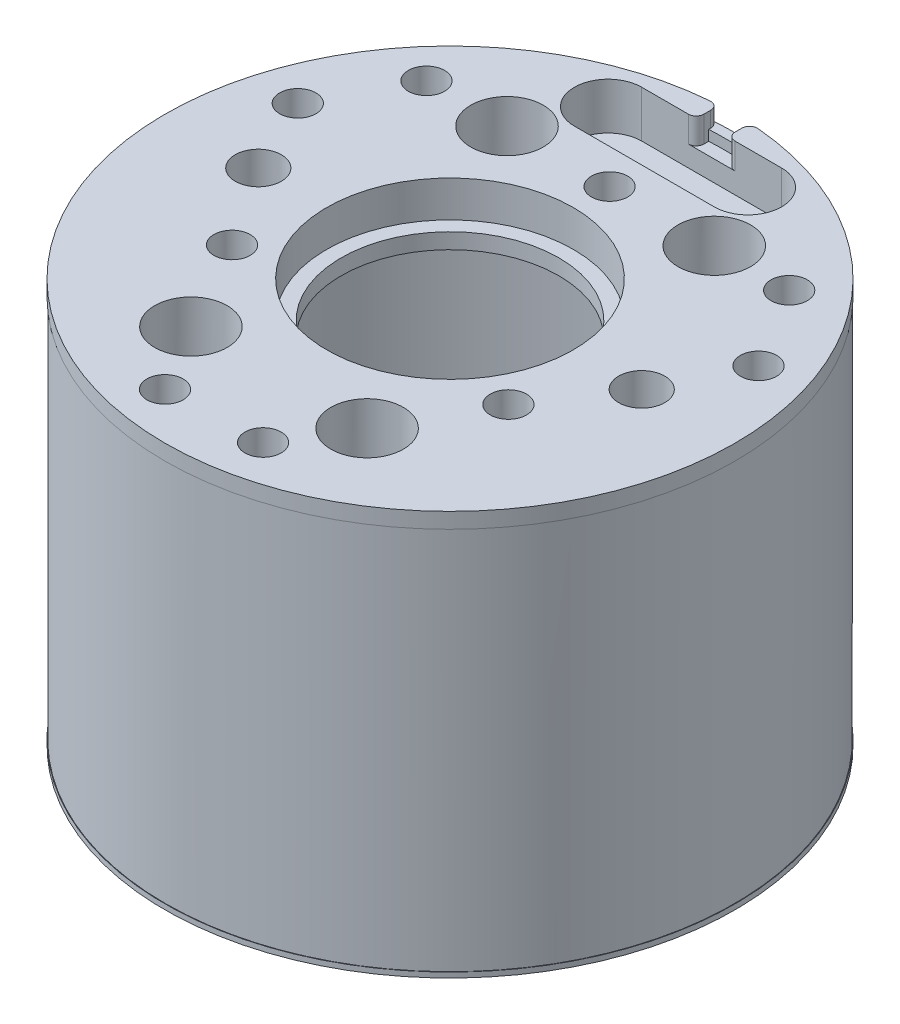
ISO-10303-21;
HEADER;
FILE_DESCRIPTION(('STEP AP214'),'2;1');
FILE_NAME('part.step','',(''),(''),'','','');
FILE_SCHEMA(('AUTOMOTIVE_DESIGN { 1 0 10303 214 1 1 1 1 }'));
ENDSEC;
DATA;
#1=APPLICATION_CONTEXT('core data for automotive mechanical design processes');
#2=APPLICATION_PROTOCOL_DEFINITION('international standard','automotive_design',2000,#1);
#3=PRODUCT_CONTEXT('',#1,'mechanical');
#4=PRODUCT('Part','Part','',(#3));
#5=PRODUCT_RELATED_PRODUCT_CATEGORY('part','',(#4));
#6=PRODUCT_DEFINITION_FORMATION('','',#4);
#7=PRODUCT_DEFINITION_CONTEXT('part definition',#1,'design');
#8=PRODUCT_DEFINITION('design','',#6,#7);
#9=PRODUCT_DEFINITION_SHAPE('','',#8);
#10=(LENGTH_UNIT() NAMED_UNIT(*) SI_UNIT(.MILLI.,.METRE.));
#11=(NAMED_UNIT(*) PLANE_ANGLE_UNIT() SI_UNIT($,.RADIAN.));
#12=(NAMED_UNIT(*) SI_UNIT($,.STERADIAN.) SOLID_ANGLE_UNIT());
#13=UNCERTAINTY_MEASURE_WITH_UNIT(LENGTH_MEASURE(1.E-05),#10,'distance_accuracy_value','');
#14=(GEOMETRIC_REPRESENTATION_CONTEXT(3) GLOBAL_UNCERTAINTY_ASSIGNED_CONTEXT((#13)) GLOBAL_UNIT_ASSIGNED_CONTEXT((#10,
#11,#12)) REPRESENTATION_CONTEXT('',''));
#15=CARTESIAN_POINT('',(0.,0.,0.));
#16=DIRECTION('',(0.,0.,1.));
#17=DIRECTION('',(1.,0.,0.));
#18=AXIS2_PLACEMENT_3D('',#15,#16,#17);
#19=CARTESIAN_POINT('',(5.334,17.272,0.));
#20=DIRECTION('',(0.,-1.,0.));
#21=DIRECTION('',(0.,0.,-1.));
#22=AXIS2_PLACEMENT_3D('',#19,#20,#21);
#23=PLANE('',#22);
#24=CARTESIAN_POINT('',(5.08,17.272,-7.874));
#25=DIRECTION('',(0.,-1.,0.));
#26=DIRECTION('',(0.,0.,-1.));
#27=AXIS2_PLACEMENT_3D('',#24,#25,#26);
#28=CIRCLE('',#27,1.778);
#29=CARTESIAN_POINT('',(5.08,17.272,-9.652));
#30=VERTEX_POINT('',#29);
#31=EDGE_CURVE('E255',#30,#30,#28,.T.);
#32=ORIENTED_EDGE('',*,*,#31,.F.);
#33=EDGE_LOOP('',(#32));
#34=FACE_BOUND('',#33,.T.);
#35=CARTESIAN_POINT('',(-5.08,17.272,-7.874));
#36=DIRECTION('',(0.,-1.,0.));
#37=DIRECTION('',(0.,0.,-1.));
#38=AXIS2_PLACEMENT_3D('',#35,#36,#37);
#39=CIRCLE('',#38,1.778);
#40=CARTESIAN_POINT('',(-5.08,17.272,-9.652));
#41=VERTEX_POINT('',#40);
#42=EDGE_CURVE('E252',#41,#41,#39,.T.);
#43=ORIENTED_EDGE('',*,*,#42,.F.);
#44=EDGE_LOOP('',(#43));
#45=FACE_BOUND('',#44,.T.);
#46=CARTESIAN_POINT('',(-4.318,17.272,8.382));
#47=DIRECTION('',(0.,-1.,0.));
#48=DIRECTION('',(0.,0.,-1.));
#49=AXIS2_PLACEMENT_3D('',#46,#47,#48);
#50=CIRCLE('',#49,1.778);
#51=CARTESIAN_POINT('',(-4.318,17.272,6.604));
#52=VERTEX_POINT('',#51);
#53=EDGE_CURVE('E249',#52,#52,#50,.T.);
#54=ORIENTED_EDGE('',*,*,#53,.F.);
#55=EDGE_LOOP('',(#54));
#56=FACE_BOUND('',#55,.T.);
#57=CARTESIAN_POINT('',(4.318,17.272,8.382));
#58=DIRECTION('',(0.,-1.,0.));
#59=DIRECTION('',(0.,0.,-1.));
#60=AXIS2_PLACEMENT_3D('',#57,#58,#59);
#61=CIRCLE('',#60,1.778);
#62=CARTESIAN_POINT('',(4.318,17.272,6.604));
#63=VERTEX_POINT('',#62);
#64=EDGE_CURVE('E246',#63,#63,#61,.T.);
#65=ORIENTED_EDGE('',*,*,#64,.F.);
#66=EDGE_LOOP('',(#65));
#67=FACE_BOUND('',#66,.T.);
#68=CARTESIAN_POINT('',(-9.398,17.272,0.));
#69=DIRECTION('',(0.,-1.,0.));
#70=DIRECTION('',(0.,0.,-1.));
#71=AXIS2_PLACEMENT_3D('',#68,#69,#70);
#72=CIRCLE('',#71,1.13029999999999);
#73=CARTESIAN_POINT('',(-9.398,17.272,-1.13029999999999));
#74=VERTEX_POINT('',#73);
#75=EDGE_CURVE('E261',#74,#74,#72,.T.);
#76=ORIENTED_EDGE('',*,*,#75,.F.);
#77=EDGE_LOOP('',(#76));
#78=FACE_BOUND('',#77,.T.);
#79=CARTESIAN_POINT('',(9.398,17.272,0.));
#80=DIRECTION('',(0.,-1.,0.));
#81=DIRECTION('',(0.,0.,-1.));
#82=AXIS2_PLACEMENT_3D('',#79,#80,#81);
#83=CIRCLE('',#82,1.13029999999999);
#84=CARTESIAN_POINT('',(9.398,17.272,-1.13029999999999));
#85=VERTEX_POINT('',#84);
#86=EDGE_CURVE('E267',#85,#85,#83,.T.);
#87=ORIENTED_EDGE('',*,*,#86,.F.);
#88=EDGE_LOOP('',(#87));
#89=FACE_BOUND('',#88,.T.);
#90=CARTESIAN_POINT('',(2.37164081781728,17.272,11.5356657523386));
#91=DIRECTION('',(0.,-1.,0.));
#92=DIRECTION('',(0.,0.,-1.));
#93=AXIS2_PLACEMENT_3D('',#90,#91,#92);
#94=CIRCLE('',#93,0.888999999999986);
#95=CARTESIAN_POINT('',(2.37164081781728,17.272,10.6466657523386));
#96=VERTEX_POINT('',#95);
#97=EDGE_CURVE('E273',#96,#96,#94,.T.);
#98=ORIENTED_EDGE('',*,*,#97,.F.);
#99=EDGE_LOOP('',(#98));
#100=FACE_BOUND('',#99,.T.);
#101=CARTESIAN_POINT('',(6.77382040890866,17.272,3.91086703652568));
#102=DIRECTION('',(0.,-1.,0.));
#103=DIRECTION('',(0.,0.,-1.));
#104=AXIS2_PLACEMENT_3D('',#101,#102,#103);
#105=CIRCLE('',#104,0.888999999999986);
#106=CARTESIAN_POINT('',(6.77382040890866,17.272,3.02186703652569));
#107=VERTEX_POINT('',#106);
#108=EDGE_CURVE('E279',#107,#107,#105,.T.);
#109=ORIENTED_EDGE('',*,*,#108,.F.);
#110=EDGE_LOOP('',(#109));
#111=FACE_BOUND('',#110,.T.);
#112=CARTESIAN_POINT('',(11.2616408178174,17.272,-3.86226592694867));
#113=DIRECTION('',(0.,-1.,0.));
#114=DIRECTION('',(0.,0.,-1.));
#115=AXIS2_PLACEMENT_3D('',#112,#113,#114);
#116=CIRCLE('',#115,0.888999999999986);
#117=CARTESIAN_POINT('',(11.2616408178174,17.272,-4.75126592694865));
#118=VERTEX_POINT('',#117);
#119=EDGE_CURVE('E285',#118,#118,#116,.T.);
#120=ORIENTED_EDGE('',*,*,#119,.F.);
#121=EDGE_LOOP('',(#120));
#122=FACE_BOUND('',#121,.T.);
#123=CARTESIAN_POINT('',(8.80435918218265,17.272,-7.82173407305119));
#124=DIRECTION('',(0.,-1.,0.));
#125=DIRECTION('',(0.,0.,-1.));
#126=AXIS2_PLACEMENT_3D('',#123,#124,#125);
#127=CIRCLE('',#126,0.888999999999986);
#128=CARTESIAN_POINT('',(8.80435918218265,17.272,-8.71073407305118));
#129=VERTEX_POINT('',#128);
#130=EDGE_CURVE('E291',#129,#129,#127,.T.);
#131=ORIENTED_EDGE('',*,*,#130,.F.);
#132=EDGE_LOOP('',(#131));
#133=FACE_BOUND('',#132,.T.);
#134=CARTESIAN_POINT('',(0.,17.272,-7.82173407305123));
#135=DIRECTION('',(0.,-1.,0.));
#136=DIRECTION('',(0.,0.,-1.));
#137=AXIS2_PLACEMENT_3D('',#134,#135,#136);
#138=CIRCLE('',#137,0.888999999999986);
#139=CARTESIAN_POINT('',(0.,17.272,-8.71073407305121));
#140=VERTEX_POINT('',#139);
#141=EDGE_CURVE('E297',#140,#140,#138,.T.);
#142=ORIENTED_EDGE('',*,*,#141,.F.);
#143=EDGE_LOOP('',(#142));
#144=FACE_BOUND('',#143,.T.);
#145=CARTESIAN_POINT('',(-8.97564081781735,17.272,-7.82173407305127));
#146=DIRECTION('',(0.,-1.,0.));
#147=DIRECTION('',(0.,0.,-1.));
#148=AXIS2_PLACEMENT_3D('',#145,#146,#147);
#149=CIRCLE('',#148,0.888999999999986);
#150=CARTESIAN_POINT('',(-8.97564081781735,17.272,-8.71073407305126));
#151=VERTEX_POINT('',#150);
#152=EDGE_CURVE('E303',#151,#151,#149,.T.);
#153=ORIENTED_EDGE('',*,*,#152,.F.);
#154=EDGE_LOOP('',(#153));
#155=FACE_BOUND('',#154,.T.);
#156=CARTESIAN_POINT('',(-11.176,17.272,-3.71393167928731));
#157=DIRECTION('',(0.,-1.,0.));
#158=DIRECTION('',(0.,0.,-1.));
#159=AXIS2_PLACEMENT_3D('',#156,#157,#158);
#160=CIRCLE('',#159,0.888999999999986);
#161=CARTESIAN_POINT('',(-11.176,17.272,-4.6029316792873));
#162=VERTEX_POINT('',#161);
#163=EDGE_CURVE('E307',#162,#162,#160,.T.);
#164=ORIENTED_EDGE('',*,*,#163,.F.);
#165=EDGE_LOOP('',(#164));
#166=FACE_BOUND('',#165,.T.);
#167=CARTESIAN_POINT('',(-6.77382040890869,17.272,3.91086703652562));
#168=DIRECTION('',(0.,-1.,0.));
#169=DIRECTION('',(0.,0.,-1.));
#170=AXIS2_PLACEMENT_3D('',#167,#168,#169);
#171=CIRCLE('',#170,0.888999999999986);
#172=CARTESIAN_POINT('',(-6.77382040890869,17.272,3.02186703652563));
#173=VERTEX_POINT('',#172);
#174=EDGE_CURVE('E311',#173,#173,#171,.T.);
#175=ORIENTED_EDGE('',*,*,#174,.F.);
#176=EDGE_LOOP('',(#175));
#177=FACE_BOUND('',#176,.T.);
#178=CARTESIAN_POINT('',(-2.286,17.272,11.684));
#179=DIRECTION('',(0.,-1.,0.));
#180=DIRECTION('',(0.,0.,-1.));
#181=AXIS2_PLACEMENT_3D('',#178,#179,#180);
#182=CIRCLE('',#181,0.888999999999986);
#183=CARTESIAN_POINT('',(-2.286,17.272,10.795));
#184=VERTEX_POINT('',#183);
#185=EDGE_CURVE('E317',#184,#184,#182,.T.);
#186=ORIENTED_EDGE('',*,*,#185,.F.);
#187=EDGE_LOOP('',(#186));
#188=FACE_BOUND('',#187,.T.);
#189=CARTESIAN_POINT('',(0.,17.272,0.));
#190=DIRECTION('',(0.,-1.,0.));
#191=DIRECTION('',(0.,0.,-1.));
#192=AXIS2_PLACEMENT_3D('',#189,#190,#191);
#193=CIRCLE('',#192,13.208);
#194=CARTESIAN_POINT('',(0.,17.272,-13.208));
#195=VERTEX_POINT('',#194);
#196=EDGE_CURVE('E320',#195,#195,#193,.T.);
#197=ORIENTED_EDGE('',*,*,#196,.T.);
#198=EDGE_LOOP('',(#197));
#199=FACE_BOUND('',#198,.T.);
#200=CARTESIAN_POINT('',(0.,17.272,0.));
#201=DIRECTION('',(0.,-1.,0.));
#202=DIRECTION('',(0.,0.,-1.));
#203=AXIS2_PLACEMENT_3D('',#200,#201,#202);
#204=CIRCLE('',#203,5.334);
#205=CARTESIAN_POINT('',(0.,17.272,-5.334));
#206=VERTEX_POINT('',#205);
#207=EDGE_CURVE('E345',#206,#206,#204,.T.);
#208=ORIENTED_EDGE('',*,*,#207,.F.);
#209=EDGE_LOOP('',(#208));
#210=FACE_BOUND('',#209,.T.);
#211=ADVANCED_FACE('F35',(#34,#45,#56,#67,#78,#89,#100,#111,#122,#133,#144,#155,#166,#177,#188,
#199,#210),#23,.T.);
#212=CARTESIAN_POINT('',(0.,0.,0.));
#213=DIRECTION('',(0.,-1.,0.));
#214=DIRECTION('',(0.,0.,-1.));
#215=AXIS2_PLACEMENT_3D('',#212,#213,#214);
#216=CYLINDRICAL_SURFACE('',#215,5.334);
#217=ORIENTED_EDGE('',*,*,#207,.T.);
#218=EDGE_LOOP('',(#217));
#219=FACE_BOUND('',#218,.T.);
#220=CARTESIAN_POINT('',(0.,18.034,0.));
#221=DIRECTION('',(0.,-1.,0.));
#222=DIRECTION('',(0.,0.,-1.));
#223=AXIS2_PLACEMENT_3D('',#220,#221,#222);
#224=CIRCLE('',#223,5.334);
#225=CARTESIAN_POINT('',(0.,18.034,-5.334));
#226=VERTEX_POINT('',#225);
#227=EDGE_CURVE('E342',#226,#226,#224,.T.);
#228=ORIENTED_EDGE('',*,*,#227,.F.);
#229=EDGE_LOOP('',(#228));
#230=FACE_BOUND('',#229,.T.);
#231=ADVANCED_FACE('F442',(#219,#230),#216,.F.);
#232=CARTESIAN_POINT('',(6.0452,18.034,0.));
#233=DIRECTION('',(0.,1.,0.));
#234=DIRECTION('',(0.,0.,1.));
#235=AXIS2_PLACEMENT_3D('',#232,#233,#234);
#236=PLANE('',#235);
#237=ORIENTED_EDGE('',*,*,#227,.T.);
#238=EDGE_LOOP('',(#237));
#239=FACE_BOUND('',#238,.T.);
#240=CARTESIAN_POINT('',(0.,18.034,0.));
#241=DIRECTION('',(0.,-1.,0.));
#242=DIRECTION('',(0.,0.,-1.));
#243=AXIS2_PLACEMENT_3D('',#240,#241,#242);
#244=CIRCLE('',#243,6.0452);
#245=CARTESIAN_POINT('',(0.,18.034,-6.0452));
#246=VERTEX_POINT('',#245);
#247=EDGE_CURVE('E339',#246,#246,#244,.T.);
#248=ORIENTED_EDGE('',*,*,#247,.F.);
#249=EDGE_LOOP('',(#248));
#250=FACE_BOUND('',#249,.T.);
#251=ADVANCED_FACE('F448',(#239,#250),#236,.T.);
#252=CARTESIAN_POINT('',(0.,0.,0.));
#253=DIRECTION('',(0.,-1.,0.));
#254=DIRECTION('',(0.,0.,-1.));
#255=AXIS2_PLACEMENT_3D('',#252,#253,#254);
#256=CYLINDRICAL_SURFACE('',#255,6.0452);
#257=ORIENTED_EDGE('',*,*,#247,.T.);
#258=EDGE_LOOP('',(#257));
#259=FACE_BOUND('',#258,.T.);
#260=CARTESIAN_POINT('',(0.,19.812,0.));
#261=DIRECTION('',(0.,-1.,0.));
#262=DIRECTION('',(0.,0.,-1.));
#263=AXIS2_PLACEMENT_3D('',#260,#261,#262);
#264=CIRCLE('',#263,6.0452);
#265=CARTESIAN_POINT('',(0.,19.812,-6.0452));
#266=VERTEX_POINT('',#265);
#267=EDGE_CURVE('E336',#266,#266,#264,.T.);
#268=ORIENTED_EDGE('',*,*,#267,.F.);
#269=EDGE_LOOP('',(#268));
#270=FACE_BOUND('',#269,.T.);
#271=ADVANCED_FACE('F439',(#259,#270),#256,.F.);
#272=CARTESIAN_POINT('',(13.97,19.812,0.));
#273=DIRECTION('',(0.,1.,0.));
#274=DIRECTION('',(0.,0.,1.));
#275=AXIS2_PLACEMENT_3D('',#272,#273,#274);
#276=PLANE('',#275);
#277=DIRECTION('',(0.,0.,-1.));
#278=VECTOR('',#277,1.);
#279=CARTESIAN_POINT('',(0.762,19.812,-12.827));
#280=LINE('',#279,#278);
#281=CARTESIAN_POINT('',(0.762,19.812,-13.208));
#282=VERTEX_POINT('',#281);
#283=CARTESIAN_POINT('',(0.762,19.812,-13.540844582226));
#284=VERTEX_POINT('',#283);
#285=EDGE_CURVE('E181',#282,#284,#280,.T.);
#286=ORIENTED_EDGE('',*,*,#285,.F.);
#287=CARTESIAN_POINT('',(1.143,19.812,-13.208));
#288=DIRECTION('',(0.,1.,0.));
#289=DIRECTION('',(0.,0.,1.));
#290=AXIS2_PLACEMENT_3D('',#287,#288,#289);
#291=CIRCLE('',#290,0.381);
#292=CARTESIAN_POINT('',(1.143,19.812,-12.827));
#293=VERTEX_POINT('',#292);
#294=EDGE_CURVE('E363',#282,#293,#291,.T.);
#295=ORIENTED_EDGE('',*,*,#294,.T.);
#296=DIRECTION('',(-1.,0.,0.));
#297=VECTOR('',#296,1.);
#298=CARTESIAN_POINT('',(-3.429,19.812,-12.827));
#299=LINE('',#298,#297);
#300=CARTESIAN_POINT('',(3.429,19.812,-12.827));
#301=VERTEX_POINT('',#300);
#302=EDGE_CURVE('E205',#301,#293,#299,.T.);
#303=ORIENTED_EDGE('',*,*,#302,.F.);
#304=CARTESIAN_POINT('',(3.429,19.812,-11.176));
#305=DIRECTION('',(0.,1.,0.));
#306=DIRECTION('',(0.,0.,1.));
#307=AXIS2_PLACEMENT_3D('',#304,#305,#306);
#308=CIRCLE('',#307,1.651);
#309=CARTESIAN_POINT('',(3.429,19.812,-9.525));
#310=VERTEX_POINT('',#309);
#311=EDGE_CURVE('E219',#310,#301,#308,.T.);
#312=ORIENTED_EDGE('',*,*,#311,.F.);
#313=DIRECTION('',(1.,0.,0.));
#314=VECTOR('',#313,1.);
#315=CARTESIAN_POINT('',(-3.429,19.812,-9.525));
#316=LINE('',#315,#314);
#317=CARTESIAN_POINT('',(-3.429,19.812,-9.525));
#318=VERTEX_POINT('',#317);
#319=EDGE_CURVE('E216',#318,#310,#316,.T.);
#320=ORIENTED_EDGE('',*,*,#319,.F.);
#321=CARTESIAN_POINT('',(-3.429,19.812,-11.176));
#322=DIRECTION('',(0.,1.,0.));
#323=DIRECTION('',(0.,0.,1.));
#324=AXIS2_PLACEMENT_3D('',#321,#322,#323);
#325=CIRCLE('',#324,1.651);
#326=CARTESIAN_POINT('',(-3.429,19.812,-12.827));
#327=VERTEX_POINT('',#326);
#328=EDGE_CURVE('E200',#327,#318,#325,.T.);
#329=ORIENTED_EDGE('',*,*,#328,.F.);
#330=CARTESIAN_POINT('',(-1.143,19.812,-12.827));
#331=VERTEX_POINT('',#330);
#332=EDGE_CURVE('E222',#331,#327,#299,.T.);
#333=ORIENTED_EDGE('',*,*,#332,.F.);
#334=CARTESIAN_POINT('',(-1.143,19.812,-13.208));
#335=DIRECTION('',(0.,1.,0.));
#336=DIRECTION('',(0.,0.,1.));
#337=AXIS2_PLACEMENT_3D('',#334,#335,#336);
#338=CIRCLE('',#337,0.381);
#339=CARTESIAN_POINT('',(-0.762,19.812,-13.208));
#340=VERTEX_POINT('',#339);
#341=EDGE_CURVE('E361',#331,#340,#338,.T.);
#342=ORIENTED_EDGE('',*,*,#341,.T.);
#343=DIRECTION('',(0.,0.,1.));
#344=VECTOR('',#343,1.);
#345=CARTESIAN_POINT('',(-0.762,19.812,-12.827));
#346=LINE('',#345,#344);
#347=CARTESIAN_POINT('',(-0.762,19.812,-13.540844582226));
#348=VERTEX_POINT('',#347);
#349=EDGE_CURVE('E176',#348,#340,#346,.T.);
#350=ORIENTED_EDGE('',*,*,#349,.F.);
#351=CARTESIAN_POINT('',(-1.143,19.812,-13.540844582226));
#352=DIRECTION('',(0.,1.,0.));
#353=DIRECTION('',(0.,0.,1.));
#354=AXIS2_PLACEMENT_3D('',#351,#352,#353);
#355=CIRCLE('',#354,0.381);
#356=CARTESIAN_POINT('',(-1.17504672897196,19.812,-13.9204944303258));
#357=VERTEX_POINT('',#356);
#358=EDGE_CURVE('E359',#348,#357,#355,.T.);
#359=ORIENTED_EDGE('',*,*,#358,.T.);
#360=CARTESIAN_POINT('',(0.,19.812,0.));
#361=DIRECTION('',(0.,-1.,0.));
#362=DIRECTION('',(0.,0.,-1.));
#363=AXIS2_PLACEMENT_3D('',#360,#361,#362);
#364=CIRCLE('',#363,13.97);
#365=CARTESIAN_POINT('',(1.17504672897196,19.812,-13.9204944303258));
#366=VERTEX_POINT('',#365);
#367=EDGE_CURVE('E334',#366,#357,#364,.T.);
#368=ORIENTED_EDGE('',*,*,#367,.F.);
#369=CARTESIAN_POINT('',(1.143,19.812,-13.540844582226));
#370=DIRECTION('',(0.,1.,0.));
#371=DIRECTION('',(0.,0.,1.));
#372=AXIS2_PLACEMENT_3D('',#369,#370,#371);
#373=CIRCLE('',#372,0.381);
#374=EDGE_CURVE('E357',#366,#284,#373,.T.);
#375=ORIENTED_EDGE('',*,*,#374,.T.);
#376=EDGE_LOOP('',(#286,#295,#303,#312,#320,#329,#333,#342,#350,#359,#368,#375));
#377=FACE_BOUND('',#376,.T.);
#378=CARTESIAN_POINT('',(5.08,19.812,-7.874));
#379=DIRECTION('',(0.,1.,0.));
#380=DIRECTION('',(0.,0.,1.));
#381=AXIS2_PLACEMENT_3D('',#378,#379,#380);
#382=CIRCLE('',#381,1.778);
#383=CARTESIAN_POINT('',(5.08,19.812,-6.096));
#384=VERTEX_POINT('',#383);
#385=EDGE_CURVE('E228',#384,#384,#382,.T.);
#386=ORIENTED_EDGE('',*,*,#385,.F.);
#387=EDGE_LOOP('',(#386));
#388=FACE_BOUND('',#387,.T.);
#389=CARTESIAN_POINT('',(-5.08,19.812,-7.874));
#390=DIRECTION('',(0.,1.,0.));
#391=DIRECTION('',(0.,0.,1.));
#392=AXIS2_PLACEMENT_3D('',#389,#390,#391);
#393=CIRCLE('',#392,1.778);
#394=CARTESIAN_POINT('',(-5.08,19.812,-6.096));
#395=VERTEX_POINT('',#394);
#396=EDGE_CURVE('E239',#395,#395,#393,.T.);
#397=ORIENTED_EDGE('',*,*,#396,.F.);
#398=EDGE_LOOP('',(#397));
#399=FACE_BOUND('',#398,.T.);
#400=CARTESIAN_POINT('',(-4.318,19.812,8.382));
#401=DIRECTION('',(0.,1.,0.));
#402=DIRECTION('',(0.,0.,1.));
#403=AXIS2_PLACEMENT_3D('',#400,#401,#402);
#404=CIRCLE('',#403,1.778);
#405=CARTESIAN_POINT('',(-4.318,19.812,10.16));
#406=VERTEX_POINT('',#405);
#407=EDGE_CURVE('E235',#406,#406,#404,.T.);
#408=ORIENTED_EDGE('',*,*,#407,.F.);
#409=EDGE_LOOP('',(#408));
#410=FACE_BOUND('',#409,.T.);
#411=CARTESIAN_POINT('',(4.318,19.812,8.382));
#412=DIRECTION('',(0.,1.,0.));
#413=DIRECTION('',(0.,0.,1.));
#414=AXIS2_PLACEMENT_3D('',#411,#412,#413);
#415=CIRCLE('',#414,1.778);
#416=CARTESIAN_POINT('',(4.318,19.812,10.16));
#417=VERTEX_POINT('',#416);
#418=EDGE_CURVE('E238',#417,#417,#415,.T.);
#419=ORIENTED_EDGE('',*,*,#418,.F.);
#420=EDGE_LOOP('',(#419));
#421=FACE_BOUND('',#420,.T.);
#422=CARTESIAN_POINT('',(-9.398,19.812,0.));
#423=DIRECTION('',(0.,1.,0.));
#424=DIRECTION('',(0.,0.,1.));
#425=AXIS2_PLACEMENT_3D('',#422,#423,#424);
#426=CIRCLE('',#425,1.13029999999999);
#427=CARTESIAN_POINT('',(-9.398,19.812,1.13029999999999));
#428=VERTEX_POINT('',#427);
#429=EDGE_CURVE('E258',#428,#428,#426,.T.);
#430=ORIENTED_EDGE('',*,*,#429,.F.);
#431=EDGE_LOOP('',(#430));
#432=FACE_BOUND('',#431,.T.);
#433=CARTESIAN_POINT('',(9.398,19.812,0.));
#434=DIRECTION('',(0.,1.,0.));
#435=DIRECTION('',(0.,0.,1.));
#436=AXIS2_PLACEMENT_3D('',#433,#434,#435);
#437=CIRCLE('',#436,1.13029999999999);
#438=CARTESIAN_POINT('',(9.398,19.812,1.13029999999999));
#439=VERTEX_POINT('',#438);
#440=EDGE_CURVE('E264',#439,#439,#437,.T.);
#441=ORIENTED_EDGE('',*,*,#440,.F.);
#442=EDGE_LOOP('',(#441));
#443=FACE_BOUND('',#442,.T.);
#444=CARTESIAN_POINT('',(2.37164081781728,19.812,11.5356657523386));
#445=DIRECTION('',(0.,1.,0.));
#446=DIRECTION('',(0.,0.,1.));
#447=AXIS2_PLACEMENT_3D('',#444,#445,#446);
#448=CIRCLE('',#447,0.888999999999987);
#449=CARTESIAN_POINT('',(2.37164081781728,19.812,12.4246657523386));
#450=VERTEX_POINT('',#449);
#451=EDGE_CURVE('E270',#450,#450,#448,.T.);
#452=ORIENTED_EDGE('',*,*,#451,.F.);
#453=EDGE_LOOP('',(#452));
#454=FACE_BOUND('',#453,.T.);
#455=CARTESIAN_POINT('',(6.77382040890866,19.812,3.91086703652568));
#456=DIRECTION('',(0.,1.,0.));
#457=DIRECTION('',(0.,0.,1.));
#458=AXIS2_PLACEMENT_3D('',#455,#456,#457);
#459=CIRCLE('',#458,0.888999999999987);
#460=CARTESIAN_POINT('',(6.77382040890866,19.812,4.79986703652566));
#461=VERTEX_POINT('',#460);
#462=EDGE_CURVE('E276',#461,#461,#459,.T.);
#463=ORIENTED_EDGE('',*,*,#462,.F.);
#464=EDGE_LOOP('',(#463));
#465=FACE_BOUND('',#464,.T.);
#466=CARTESIAN_POINT('',(11.2616408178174,19.812,-3.86226592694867));
#467=DIRECTION('',(0.,1.,0.));
#468=DIRECTION('',(0.,0.,1.));
#469=AXIS2_PLACEMENT_3D('',#466,#467,#468);
#470=CIRCLE('',#469,0.888999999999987);
#471=CARTESIAN_POINT('',(11.2616408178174,19.812,-2.97326592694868));
#472=VERTEX_POINT('',#471);
#473=EDGE_CURVE('E282',#472,#472,#470,.T.);
#474=ORIENTED_EDGE('',*,*,#473,.F.);
#475=EDGE_LOOP('',(#474));
#476=FACE_BOUND('',#475,.T.);
#477=CARTESIAN_POINT('',(8.80435918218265,19.812,-7.82173407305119));
#478=DIRECTION('',(0.,1.,0.));
#479=DIRECTION('',(0.,0.,1.));
#480=AXIS2_PLACEMENT_3D('',#477,#478,#479);
#481=CIRCLE('',#480,0.888999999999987);
#482=CARTESIAN_POINT('',(8.80435918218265,19.812,-6.9327340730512));
#483=VERTEX_POINT('',#482);
#484=EDGE_CURVE('E288',#483,#483,#481,.T.);
#485=ORIENTED_EDGE('',*,*,#484,.F.);
#486=EDGE_LOOP('',(#485));
#487=FACE_BOUND('',#486,.T.);
#488=CARTESIAN_POINT('',(0.,19.812,-7.82173407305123));
#489=DIRECTION('',(0.,1.,0.));
#490=DIRECTION('',(0.,0.,1.));
#491=AXIS2_PLACEMENT_3D('',#488,#489,#490);
#492=CIRCLE('',#491,0.888999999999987);
#493=CARTESIAN_POINT('',(0.,19.812,-6.93273407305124));
#494=VERTEX_POINT('',#493);
#495=EDGE_CURVE('E294',#494,#494,#492,.T.);
#496=ORIENTED_EDGE('',*,*,#495,.F.);
#497=EDGE_LOOP('',(#496));
#498=FACE_BOUND('',#497,.T.);
#499=CARTESIAN_POINT('',(-8.97564081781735,19.812,-7.82173407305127));
#500=DIRECTION('',(0.,1.,0.));
#501=DIRECTION('',(0.,0.,1.));
#502=AXIS2_PLACEMENT_3D('',#499,#500,#501);
#503=CIRCLE('',#502,0.888999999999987);
#504=CARTESIAN_POINT('',(-8.97564081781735,19.812,-6.93273407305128));
#505=VERTEX_POINT('',#504);
#506=EDGE_CURVE('E300',#505,#505,#503,.T.);
#507=ORIENTED_EDGE('',*,*,#506,.F.);
#508=EDGE_LOOP('',(#507));
#509=FACE_BOUND('',#508,.T.);
#510=CARTESIAN_POINT('',(-11.176,19.812,-3.71393167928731));
#511=DIRECTION('',(0.,1.,0.));
#512=DIRECTION('',(0.,0.,1.));
#513=AXIS2_PLACEMENT_3D('',#510,#511,#512);
#514=CIRCLE('',#513,0.888999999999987);
#515=CARTESIAN_POINT('',(-11.176,19.812,-2.82493167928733));
#516=VERTEX_POINT('',#515);
#517=EDGE_CURVE('E304',#516,#516,#514,.T.);
#518=ORIENTED_EDGE('',*,*,#517,.F.);
#519=EDGE_LOOP('',(#518));
#520=FACE_BOUND('',#519,.T.);
#521=CARTESIAN_POINT('',(-6.77382040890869,19.812,3.91086703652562));
#522=DIRECTION('',(0.,1.,0.));
#523=DIRECTION('',(0.,0.,1.));
#524=AXIS2_PLACEMENT_3D('',#521,#522,#523);
#525=CIRCLE('',#524,0.888999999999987);
#526=CARTESIAN_POINT('',(-6.77382040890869,19.812,4.7998670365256));
#527=VERTEX_POINT('',#526);
#528=EDGE_CURVE('E308',#527,#527,#525,.T.);
#529=ORIENTED_EDGE('',*,*,#528,.F.);
#530=EDGE_LOOP('',(#529));
#531=FACE_BOUND('',#530,.T.);
#532=CARTESIAN_POINT('',(-2.286,19.812,11.684));
#533=DIRECTION('',(0.,1.,0.));
#534=DIRECTION('',(0.,0.,1.));
#535=AXIS2_PLACEMENT_3D('',#532,#533,#534);
#536=CIRCLE('',#535,0.888999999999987);
#537=CARTESIAN_POINT('',(-2.286,19.812,12.573));
#538=VERTEX_POINT('',#537);
#539=EDGE_CURVE('E314',#538,#538,#536,.T.);
#540=ORIENTED_EDGE('',*,*,#539,.F.);
#541=EDGE_LOOP('',(#540));
#542=FACE_BOUND('',#541,.T.);
#543=ORIENTED_EDGE('',*,*,#267,.T.);
#544=EDGE_LOOP('',(#543));
#545=FACE_BOUND('',#544,.T.);
#546=ADVANCED_FACE('F395',(#377,#388,#399,#410,#421,#432,#443,#454,#465,#476,#487,#498,#509,
#520,#531,#542,#545),#276,.T.);
#547=CARTESIAN_POINT('',(0.,0.,0.));
#548=DIRECTION('',(0.,-1.,0.));
#549=DIRECTION('',(0.,0.,-1.));
#550=AXIS2_PLACEMENT_3D('',#547,#548,#549);
#551=CYLINDRICAL_SURFACE('',#550,13.97);
#552=ORIENTED_EDGE('',*,*,#367,.T.);
#553=DIRECTION('',(0.,-1.,0.));
#554=VECTOR('',#553,1.);
#555=CARTESIAN_POINT('',(-1.17504672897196,0.,-13.9204944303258));
#556=LINE('',#555,#554);
#557=CARTESIAN_POINT('',(-1.17504672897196,19.05,-13.9204944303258));
#558=VERTEX_POINT('',#557);
#559=EDGE_CURVE('E58',#357,#558,#556,.T.);
#560=ORIENTED_EDGE('',*,*,#559,.T.);
#561=CARTESIAN_POINT('',(0.,19.05,0.));
#562=DIRECTION('',(0.,-1.,0.));
#563=DIRECTION('',(0.,0.,-1.));
#564=AXIS2_PLACEMENT_3D('',#561,#562,#563);
#565=CIRCLE('',#564,13.97);
#566=CARTESIAN_POINT('',(1.17504672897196,19.05,-13.9204944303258));
#567=VERTEX_POINT('',#566);
#568=EDGE_CURVE('E332',#567,#558,#565,.T.);
#569=ORIENTED_EDGE('',*,*,#568,.F.);
#570=DIRECTION('',(0.,-1.,0.));
#571=VECTOR('',#570,1.);
#572=CARTESIAN_POINT('',(1.17504672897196,0.,-13.9204944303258));
#573=LINE('',#572,#571);
#574=EDGE_CURVE('E152',#567,#366,#573,.F.);
#575=ORIENTED_EDGE('',*,*,#574,.T.);
#576=EDGE_LOOP('',(#552,#560,#569,#575));
#577=FACE_BOUND('',#576,.T.);
#578=ADVANCED_FACE('F430',(#577),#551,.T.);
#579=CARTESIAN_POINT('',(13.462,19.05,0.));
#580=DIRECTION('',(0.,-1.,0.));
#581=DIRECTION('',(0.,0.,-1.));
#582=AXIS2_PLACEMENT_3D('',#579,#580,#581);
#583=PLANE('',#582);
#584=CARTESIAN_POINT('',(0.,19.05,0.));
#585=DIRECTION('',(0.,-1.,0.));
#586=DIRECTION('',(0.,0.,-1.));
#587=AXIS2_PLACEMENT_3D('',#584,#585,#586);
#588=CIRCLE('',#587,13.9446);
#589=CARTESIAN_POINT('',(1.03478378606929,19.05,-13.9061530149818));
#590=VERTEX_POINT('',#589);
#591=CARTESIAN_POINT('',(-1.03478378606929,19.05,-13.9061530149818));
#592=VERTEX_POINT('',#591);
#593=EDGE_CURVE('E156',#590,#592,#588,.T.);
#594=ORIENTED_EDGE('',*,*,#593,.F.);
#595=CARTESIAN_POINT('',(1.143,19.05,-13.540844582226));
#596=DIRECTION('',(0.,-1.,0.));
#597=DIRECTION('',(0.,0.,-1.));
#598=AXIS2_PLACEMENT_3D('',#595,#596,#597);
#599=CIRCLE('',#598,0.381);
#600=EDGE_CURVE('E145',#590,#567,#599,.T.);
#601=ORIENTED_EDGE('',*,*,#600,.T.);
#602=ORIENTED_EDGE('',*,*,#568,.T.);
#603=CARTESIAN_POINT('',(-1.143,19.05,-13.540844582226));
#604=DIRECTION('',(0.,-1.,0.));
#605=DIRECTION('',(0.,0.,-1.));
#606=AXIS2_PLACEMENT_3D('',#603,#604,#605);
#607=CIRCLE('',#606,0.381);
#608=EDGE_CURVE('E158',#558,#592,#607,.T.);
#609=ORIENTED_EDGE('',*,*,#608,.T.);
#610=EDGE_LOOP('',(#594,#601,#602,#609));
#611=FACE_BOUND('',#610,.T.);
#612=ADVANCED_FACE('F157',(#611),#583,.T.);
#613=CARTESIAN_POINT('',(13.97,0.253999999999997,0.));
#614=DIRECTION('',(0.,1.,0.));
#615=DIRECTION('',(0.,0.,1.));
#616=AXIS2_PLACEMENT_3D('',#613,#614,#615);
#617=PLANE('',#616);
#618=CARTESIAN_POINT('',(0.,0.253999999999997,0.));
#619=DIRECTION('',(0.,1.,0.));
#620=DIRECTION('',(0.,0.,1.));
#621=AXIS2_PLACEMENT_3D('',#618,#619,#620);
#622=CIRCLE('',#621,13.9446);
#623=CARTESIAN_POINT('',(0.,0.253999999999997,13.9446));
#624=VERTEX_POINT('',#623);
#625=EDGE_CURVE('E11',#624,#624,#622,.T.);
#626=ORIENTED_EDGE('',*,*,#625,.F.);
#627=EDGE_LOOP('',(#626));
#628=FACE_BOUND('',#627,.T.);
#629=CARTESIAN_POINT('',(0.,0.253999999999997,0.));
#630=DIRECTION('',(0.,-1.,0.));
#631=DIRECTION('',(0.,0.,-1.));
#632=AXIS2_PLACEMENT_3D('',#629,#630,#631);
#633=CIRCLE('',#632,13.97);
#634=CARTESIAN_POINT('',(0.,0.253999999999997,-13.97));
#635=VERTEX_POINT('',#634);
#636=EDGE_CURVE('E329',#635,#635,#633,.T.);
#637=ORIENTED_EDGE('',*,*,#636,.F.);
#638=EDGE_LOOP('',(#637));
#639=FACE_BOUND('',#638,.T.);
#640=ADVANCED_FACE('F437',(#628,#639),#617,.T.);
#641=CARTESIAN_POINT('',(0.,0.,0.));
#642=DIRECTION('',(0.,-1.,0.));
#643=DIRECTION('',(0.,0.,-1.));
#644=AXIS2_PLACEMENT_3D('',#641,#642,#643);
#645=CYLINDRICAL_SURFACE('',#644,13.97);
#646=ORIENTED_EDGE('',*,*,#636,.T.);
#647=EDGE_LOOP('',(#646));
#648=FACE_BOUND('',#647,.T.);
#649=CARTESIAN_POINT('',(0.,0.,0.));
#650=DIRECTION('',(0.,-1.,0.));
#651=DIRECTION('',(0.,0.,-1.));
#652=AXIS2_PLACEMENT_3D('',#649,#650,#651);
#653=CIRCLE('',#652,13.97);
#654=CARTESIAN_POINT('',(0.,0.,-13.97));
#655=VERTEX_POINT('',#654);
#656=EDGE_CURVE('E326',#655,#655,#653,.T.);
#657=ORIENTED_EDGE('',*,*,#656,.F.);
#658=EDGE_LOOP('',(#657));
#659=FACE_BOUND('',#658,.T.);
#660=ADVANCED_FACE('F555',(#648,#659),#645,.T.);
#661=CARTESIAN_POINT('',(13.208,0.,0.));
#662=DIRECTION('',(0.,-1.,0.));
#663=DIRECTION('',(0.,0.,-1.));
#664=AXIS2_PLACEMENT_3D('',#661,#662,#663);
#665=PLANE('',#664);
#666=ORIENTED_EDGE('',*,*,#656,.T.);
#667=EDGE_LOOP('',(#666));
#668=FACE_BOUND('',#667,.T.);
#669=CARTESIAN_POINT('',(0.,0.,0.));
#670=DIRECTION('',(0.,-1.,0.));
#671=DIRECTION('',(0.,0.,-1.));
#672=AXIS2_PLACEMENT_3D('',#669,#670,#671);
#673=CIRCLE('',#672,13.208);
#674=CARTESIAN_POINT('',(0.,0.,-13.208));
#675=VERTEX_POINT('',#674);
#676=EDGE_CURVE('E323',#675,#675,#673,.T.);
#677=ORIENTED_EDGE('',*,*,#676,.F.);
#678=EDGE_LOOP('',(#677));
#679=FACE_BOUND('',#678,.T.);
#680=ADVANCED_FACE('F551',(#668,#679),#665,.T.);
#681=CARTESIAN_POINT('',(0.,0.,0.));
#682=DIRECTION('',(0.,-1.,0.));
#683=DIRECTION('',(0.,0.,-1.));
#684=AXIS2_PLACEMENT_3D('',#681,#682,#683);
#685=CYLINDRICAL_SURFACE('',#684,13.208);
#686=ORIENTED_EDGE('',*,*,#676,.T.);
#687=EDGE_LOOP('',(#686));
#688=FACE_BOUND('',#687,.T.);
#689=ORIENTED_EDGE('',*,*,#196,.F.);
#690=EDGE_LOOP('',(#689));
#691=FACE_BOUND('',#690,.T.);
#692=ADVANCED_FACE('F547',(#688,#691),#685,.F.);
#693=CARTESIAN_POINT('',(-2.286,19.812,11.684));
#694=DIRECTION('',(0.,1.,0.));
#695=DIRECTION('',(0.,0.,1.));
#696=AXIS2_PLACEMENT_3D('',#693,#694,#695);
#697=CYLINDRICAL_SURFACE('',#696,0.888999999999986);
#698=ORIENTED_EDGE('',*,*,#185,.T.);
#699=EDGE_LOOP('',(#698));
#700=FACE_BOUND('',#699,.T.);
#701=ORIENTED_EDGE('',*,*,#539,.T.);
#702=EDGE_LOOP('',(#701));
#703=FACE_BOUND('',#702,.T.);
#704=ADVANCED_FACE('F543',(#700,#703),#697,.F.);
#705=CARTESIAN_POINT('',(-6.77382040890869,19.812,3.91086703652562));
#706=DIRECTION('',(0.,1.,0.));
#707=DIRECTION('',(0.,0.,1.));
#708=AXIS2_PLACEMENT_3D('',#705,#706,#707);
#709=CYLINDRICAL_SURFACE('',#708,0.888999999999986);
#710=ORIENTED_EDGE('',*,*,#174,.T.);
#711=EDGE_LOOP('',(#710));
#712=FACE_BOUND('',#711,.T.);
#713=ORIENTED_EDGE('',*,*,#528,.T.);
#714=EDGE_LOOP('',(#713));
#715=FACE_BOUND('',#714,.T.);
#716=ADVANCED_FACE('F539',(#712,#715),#709,.F.);
#717=CARTESIAN_POINT('',(-11.176,19.812,-3.71393167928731));
#718=DIRECTION('',(0.,1.,0.));
#719=DIRECTION('',(0.,0.,1.));
#720=AXIS2_PLACEMENT_3D('',#717,#718,#719);
#721=CYLINDRICAL_SURFACE('',#720,0.888999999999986);
#722=ORIENTED_EDGE('',*,*,#163,.T.);
#723=EDGE_LOOP('',(#722));
#724=FACE_BOUND('',#723,.T.);
#725=ORIENTED_EDGE('',*,*,#517,.T.);
#726=EDGE_LOOP('',(#725));
#727=FACE_BOUND('',#726,.T.);
#728=ADVANCED_FACE('F535',(#724,#727),#721,.F.);
#729=CARTESIAN_POINT('',(-8.97564081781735,19.812,-7.82173407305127));
#730=DIRECTION('',(0.,1.,0.));
#731=DIRECTION('',(0.,0.,1.));
#732=AXIS2_PLACEMENT_3D('',#729,#730,#731);
#733=CYLINDRICAL_SURFACE('',#732,0.888999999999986);
#734=ORIENTED_EDGE('',*,*,#152,.T.);
#735=EDGE_LOOP('',(#734));
#736=FACE_BOUND('',#735,.T.);
#737=ORIENTED_EDGE('',*,*,#506,.T.);
#738=EDGE_LOOP('',(#737));
#739=FACE_BOUND('',#738,.T.);
#740=ADVANCED_FACE('F531',(#736,#739),#733,.F.);
#741=CARTESIAN_POINT('',(0.,19.812,-7.82173407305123));
#742=DIRECTION('',(0.,1.,0.));
#743=DIRECTION('',(0.,0.,1.));
#744=AXIS2_PLACEMENT_3D('',#741,#742,#743);
#745=CYLINDRICAL_SURFACE('',#744,0.888999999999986);
#746=ORIENTED_EDGE('',*,*,#141,.T.);
#747=EDGE_LOOP('',(#746));
#748=FACE_BOUND('',#747,.T.);
#749=ORIENTED_EDGE('',*,*,#495,.T.);
#750=EDGE_LOOP('',(#749));
#751=FACE_BOUND('',#750,.T.);
#752=ADVANCED_FACE('F527',(#748,#751),#745,.F.);
#753=CARTESIAN_POINT('',(8.80435918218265,19.812,-7.82173407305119));
#754=DIRECTION('',(0.,1.,0.));
#755=DIRECTION('',(0.,0.,1.));
#756=AXIS2_PLACEMENT_3D('',#753,#754,#755);
#757=CYLINDRICAL_SURFACE('',#756,0.888999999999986);
#758=ORIENTED_EDGE('',*,*,#130,.T.);
#759=EDGE_LOOP('',(#758));
#760=FACE_BOUND('',#759,.T.);
#761=ORIENTED_EDGE('',*,*,#484,.T.);
#762=EDGE_LOOP('',(#761));
#763=FACE_BOUND('',#762,.T.);
#764=ADVANCED_FACE('F523',(#760,#763),#757,.F.);
#765=CARTESIAN_POINT('',(11.2616408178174,19.812,-3.86226592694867));
#766=DIRECTION('',(0.,1.,0.));
#767=DIRECTION('',(0.,0.,1.));
#768=AXIS2_PLACEMENT_3D('',#765,#766,#767);
#769=CYLINDRICAL_SURFACE('',#768,0.888999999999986);
#770=ORIENTED_EDGE('',*,*,#119,.T.);
#771=EDGE_LOOP('',(#770));
#772=FACE_BOUND('',#771,.T.);
#773=ORIENTED_EDGE('',*,*,#473,.T.);
#774=EDGE_LOOP('',(#773));
#775=FACE_BOUND('',#774,.T.);
#776=ADVANCED_FACE('F519',(#772,#775),#769,.F.);
#777=CARTESIAN_POINT('',(6.77382040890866,19.812,3.91086703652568));
#778=DIRECTION('',(0.,1.,0.));
#779=DIRECTION('',(0.,0.,1.));
#780=AXIS2_PLACEMENT_3D('',#777,#778,#779);
#781=CYLINDRICAL_SURFACE('',#780,0.888999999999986);
#782=ORIENTED_EDGE('',*,*,#108,.T.);
#783=EDGE_LOOP('',(#782));
#784=FACE_BOUND('',#783,.T.);
#785=ORIENTED_EDGE('',*,*,#462,.T.);
#786=EDGE_LOOP('',(#785));
#787=FACE_BOUND('',#786,.T.);
#788=ADVANCED_FACE('F515',(#784,#787),#781,.F.);
#789=CARTESIAN_POINT('',(2.37164081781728,19.812,11.5356657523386));
#790=DIRECTION('',(0.,1.,0.));
#791=DIRECTION('',(0.,0.,1.));
#792=AXIS2_PLACEMENT_3D('',#789,#790,#791);
#793=CYLINDRICAL_SURFACE('',#792,0.888999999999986);
#794=ORIENTED_EDGE('',*,*,#97,.T.);
#795=EDGE_LOOP('',(#794));
#796=FACE_BOUND('',#795,.T.);
#797=ORIENTED_EDGE('',*,*,#451,.T.);
#798=EDGE_LOOP('',(#797));
#799=FACE_BOUND('',#798,.T.);
#800=ADVANCED_FACE('F511',(#796,#799),#793,.F.);
#801=CARTESIAN_POINT('',(9.398,19.812,0.));
#802=DIRECTION('',(0.,1.,0.));
#803=DIRECTION('',(0.,0.,1.));
#804=AXIS2_PLACEMENT_3D('',#801,#802,#803);
#805=CYLINDRICAL_SURFACE('',#804,1.13029999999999);
#806=ORIENTED_EDGE('',*,*,#86,.T.);
#807=EDGE_LOOP('',(#806));
#808=FACE_BOUND('',#807,.T.);
#809=ORIENTED_EDGE('',*,*,#440,.T.);
#810=EDGE_LOOP('',(#809));
#811=FACE_BOUND('',#810,.T.);
#812=ADVANCED_FACE('F507',(#808,#811),#805,.F.);
#813=CARTESIAN_POINT('',(-9.398,19.812,0.));
#814=DIRECTION('',(0.,1.,0.));
#815=DIRECTION('',(0.,0.,1.));
#816=AXIS2_PLACEMENT_3D('',#813,#814,#815);
#817=CYLINDRICAL_SURFACE('',#816,1.13029999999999);
#818=ORIENTED_EDGE('',*,*,#75,.T.);
#819=EDGE_LOOP('',(#818));
#820=FACE_BOUND('',#819,.T.);
#821=ORIENTED_EDGE('',*,*,#429,.T.);
#822=EDGE_LOOP('',(#821));
#823=FACE_BOUND('',#822,.T.);
#824=ADVANCED_FACE('F503',(#820,#823),#817,.F.);
#825=CARTESIAN_POINT('',(4.318,0.,8.382));
#826=DIRECTION('',(0.,1.,0.));
#827=DIRECTION('',(0.,0.,1.));
#828=AXIS2_PLACEMENT_3D('',#825,#826,#827);
#829=CYLINDRICAL_SURFACE('',#828,1.778);
#830=ORIENTED_EDGE('',*,*,#64,.T.);
#831=EDGE_LOOP('',(#830));
#832=FACE_BOUND('',#831,.T.);
#833=ORIENTED_EDGE('',*,*,#418,.T.);
#834=EDGE_LOOP('',(#833));
#835=FACE_BOUND('',#834,.T.);
#836=ADVANCED_FACE('F493',(#832,#835),#829,.F.);
#837=CARTESIAN_POINT('',(-4.318,0.,8.382));
#838=DIRECTION('',(0.,1.,0.));
#839=DIRECTION('',(0.,0.,1.));
#840=AXIS2_PLACEMENT_3D('',#837,#838,#839);
#841=CYLINDRICAL_SURFACE('',#840,1.778);
#842=ORIENTED_EDGE('',*,*,#53,.T.);
#843=EDGE_LOOP('',(#842));
#844=FACE_BOUND('',#843,.T.);
#845=ORIENTED_EDGE('',*,*,#407,.T.);
#846=EDGE_LOOP('',(#845));
#847=FACE_BOUND('',#846,.T.);
#848=ADVANCED_FACE('F489',(#844,#847),#841,.F.);
#849=CARTESIAN_POINT('',(-5.08,0.,-7.874));
#850=DIRECTION('',(0.,1.,0.));
#851=DIRECTION('',(0.,0.,1.));
#852=AXIS2_PLACEMENT_3D('',#849,#850,#851);
#853=CYLINDRICAL_SURFACE('',#852,1.778);
#854=ORIENTED_EDGE('',*,*,#42,.T.);
#855=EDGE_LOOP('',(#854));
#856=FACE_BOUND('',#855,.T.);
#857=ORIENTED_EDGE('',*,*,#396,.T.);
#858=EDGE_LOOP('',(#857));
#859=FACE_BOUND('',#858,.T.);
#860=ADVANCED_FACE('F492',(#856,#859),#853,.F.);
#861=CARTESIAN_POINT('',(5.08,0.,-7.874));
#862=DIRECTION('',(0.,1.,0.));
#863=DIRECTION('',(0.,0.,1.));
#864=AXIS2_PLACEMENT_3D('',#861,#862,#863);
#865=CYLINDRICAL_SURFACE('',#864,1.778);
#866=ORIENTED_EDGE('',*,*,#31,.T.);
#867=EDGE_LOOP('',(#866));
#868=FACE_BOUND('',#867,.T.);
#869=ORIENTED_EDGE('',*,*,#385,.T.);
#870=EDGE_LOOP('',(#869));
#871=FACE_BOUND('',#870,.T.);
#872=ADVANCED_FACE('F488',(#868,#871),#865,.F.);
#873=CARTESIAN_POINT('',(-3.429,17.526,-11.176));
#874=DIRECTION('',(0.,1.,0.));
#875=DIRECTION('',(0.,0.,1.));
#876=AXIS2_PLACEMENT_3D('',#873,#874,#875);
#877=CYLINDRICAL_SURFACE('',#876,1.651);
#878=ORIENTED_EDGE('',*,*,#328,.T.);
#879=DIRECTION('',(0.,1.,0.));
#880=VECTOR('',#879,1.);
#881=CARTESIAN_POINT('',(-3.429,17.526,-9.525));
#882=LINE('',#881,#880);
#883=CARTESIAN_POINT('',(-3.429,17.526,-9.525));
#884=VERTEX_POINT('',#883);
#885=EDGE_CURVE('E214',#884,#318,#882,.T.);
#886=ORIENTED_EDGE('',*,*,#885,.F.);
#887=CARTESIAN_POINT('',(-3.429,17.526,-11.176));
#888=DIRECTION('',(0.,1.,0.));
#889=DIRECTION('',(0.,0.,1.));
#890=AXIS2_PLACEMENT_3D('',#887,#888,#889);
#891=CIRCLE('',#890,1.651);
#892=CARTESIAN_POINT('',(-3.429,17.526,-12.827));
#893=VERTEX_POINT('',#892);
#894=EDGE_CURVE('E201',#893,#884,#891,.T.);
#895=ORIENTED_EDGE('',*,*,#894,.F.);
#896=DIRECTION('',(0.,1.,0.));
#897=VECTOR('',#896,1.);
#898=CARTESIAN_POINT('',(-3.429,17.526,-12.827));
#899=LINE('',#898,#897);
#900=EDGE_CURVE('E225',#893,#327,#899,.T.);
#901=ORIENTED_EDGE('',*,*,#900,.T.);
#902=EDGE_LOOP('',(#878,#886,#895,#901));
#903=FACE_BOUND('',#902,.T.);
#904=ADVANCED_FACE('F401',(#903),#877,.F.);
#905=CARTESIAN_POINT('',(-3.429,17.526,-12.827));
#906=DIRECTION('',(0.,0.,-1.));
#907=DIRECTION('',(-1.,0.,0.));
#908=AXIS2_PLACEMENT_3D('',#905,#906,#907);
#909=PLANE('',#908);
#910=ORIENTED_EDGE('',*,*,#302,.T.);
#911=DIRECTION('',(0.,1.,0.));
#912=VECTOR('',#911,1.);
#913=CARTESIAN_POINT('',(1.143,17.526,-12.827));
#914=LINE('',#913,#912);
#915=CARTESIAN_POINT('',(1.143,18.542,-12.827));
#916=VERTEX_POINT('',#915);
#917=EDGE_CURVE('E368',#293,#916,#914,.F.);
#918=ORIENTED_EDGE('',*,*,#917,.T.);
#919=DIRECTION('',(1.,0.,0.));
#920=VECTOR('',#919,1.);
#921=CARTESIAN_POINT('',(0.762,18.542,-12.827));
#922=LINE('',#921,#920);
#923=CARTESIAN_POINT('',(-1.143,18.542,-12.827));
#924=VERTEX_POINT('',#923);
#925=EDGE_CURVE('E180',#924,#916,#922,.T.);
#926=ORIENTED_EDGE('',*,*,#925,.F.);
#927=DIRECTION('',(0.,1.,0.));
#928=VECTOR('',#927,1.);
#929=CARTESIAN_POINT('',(-1.143,17.526,-12.827));
#930=LINE('',#929,#928);
#931=EDGE_CURVE('E365',#924,#331,#930,.T.);
#932=ORIENTED_EDGE('',*,*,#931,.T.);
#933=ORIENTED_EDGE('',*,*,#332,.T.);
#934=ORIENTED_EDGE('',*,*,#900,.F.);
#935=DIRECTION('',(-1.,0.,0.));
#936=VECTOR('',#935,1.);
#937=CARTESIAN_POINT('',(-3.429,17.526,-12.827));
#938=LINE('',#937,#936);
#939=CARTESIAN_POINT('',(3.429,17.526,-12.827));
#940=VERTEX_POINT('',#939);
#941=EDGE_CURVE('E211',#940,#893,#938,.T.);
#942=ORIENTED_EDGE('',*,*,#941,.F.);
#943=DIRECTION('',(0.,1.,0.));
#944=VECTOR('',#943,1.);
#945=CARTESIAN_POINT('',(3.429,17.526,-12.827));
#946=LINE('',#945,#944);
#947=EDGE_CURVE('E229',#940,#301,#946,.T.);
#948=ORIENTED_EDGE('',*,*,#947,.T.);
#949=EDGE_LOOP('',(#910,#918,#926,#932,#933,#934,#942,#948));
#950=FACE_BOUND('',#949,.T.);
#951=ADVANCED_FACE('F391',(#950),#909,.F.);
#952=CARTESIAN_POINT('',(3.429,17.526,-11.176));
#953=DIRECTION('',(0.,1.,0.));
#954=DIRECTION('',(0.,0.,1.));
#955=AXIS2_PLACEMENT_3D('',#952,#953,#954);
#956=CYLINDRICAL_SURFACE('',#955,1.651);
#957=ORIENTED_EDGE('',*,*,#311,.T.);
#958=ORIENTED_EDGE('',*,*,#947,.F.);
#959=CARTESIAN_POINT('',(3.429,17.526,-11.176));
#960=DIRECTION('',(0.,1.,0.));
#961=DIRECTION('',(0.,0.,1.));
#962=AXIS2_PLACEMENT_3D('',#959,#960,#961);
#963=CIRCLE('',#962,1.651);
#964=CARTESIAN_POINT('',(3.429,17.526,-9.525));
#965=VERTEX_POINT('',#964);
#966=EDGE_CURVE('E208',#965,#940,#963,.T.);
#967=ORIENTED_EDGE('',*,*,#966,.F.);
#968=DIRECTION('',(0.,1.,0.));
#969=VECTOR('',#968,1.);
#970=CARTESIAN_POINT('',(3.429,17.526,-9.525));
#971=LINE('',#970,#969);
#972=EDGE_CURVE('E231',#965,#310,#971,.T.);
#973=ORIENTED_EDGE('',*,*,#972,.T.);
#974=EDGE_LOOP('',(#957,#958,#967,#973));
#975=FACE_BOUND('',#974,.T.);
#976=ADVANCED_FACE('F413',(#975),#956,.F.);
#977=CARTESIAN_POINT('',(-3.429,17.526,-9.525));
#978=DIRECTION('',(0.,0.,1.));
#979=DIRECTION('',(1.,0.,0.));
#980=AXIS2_PLACEMENT_3D('',#977,#978,#979);
#981=PLANE('',#980);
#982=ORIENTED_EDGE('',*,*,#319,.T.);
#983=ORIENTED_EDGE('',*,*,#972,.F.);
#984=DIRECTION('',(1.,0.,0.));
#985=VECTOR('',#984,1.);
#986=CARTESIAN_POINT('',(-3.429,17.526,-9.525));
#987=LINE('',#986,#985);
#988=EDGE_CURVE('E204',#884,#965,#987,.T.);
#989=ORIENTED_EDGE('',*,*,#988,.F.);
#990=ORIENTED_EDGE('',*,*,#885,.T.);
#991=EDGE_LOOP('',(#982,#983,#989,#990));
#992=FACE_BOUND('',#991,.T.);
#993=ADVANCED_FACE('F405',(#992),#981,.F.);
#994=CARTESIAN_POINT('',(-3.429,17.526,-11.176));
#995=DIRECTION('',(0.,1.,0.));
#996=DIRECTION('',(0.,0.,1.));
#997=AXIS2_PLACEMENT_3D('',#994,#995,#996);
#998=PLANE('',#997);
#999=ORIENTED_EDGE('',*,*,#894,.T.);
#1000=ORIENTED_EDGE('',*,*,#988,.T.);
#1001=ORIENTED_EDGE('',*,*,#966,.T.);
#1002=ORIENTED_EDGE('',*,*,#941,.T.);
#1003=EDGE_LOOP('',(#999,#1000,#1001,#1002));
#1004=FACE_BOUND('',#1003,.T.);
#1005=ADVANCED_FACE('F408',(#1004),#998,.T.);
#1006=CARTESIAN_POINT('',(-0.762,18.542,-12.827));
#1007=DIRECTION('',(-1.,0.,0.));
#1008=DIRECTION('',(0.,0.,1.));
#1009=AXIS2_PLACEMENT_3D('',#1006,#1007,#1008);
#1010=PLANE('',#1009);
#1011=ORIENTED_EDGE('',*,*,#349,.T.);
#1012=DIRECTION('',(0.,1.,0.));
#1013=VECTOR('',#1012,1.);
#1014=CARTESIAN_POINT('',(-0.762,18.542,-13.208));
#1015=LINE('',#1014,#1013);
#1016=CARTESIAN_POINT('',(-0.762,18.542,-13.208));
#1017=VERTEX_POINT('',#1016);
#1018=EDGE_CURVE('E374',#340,#1017,#1015,.F.);
#1019=ORIENTED_EDGE('',*,*,#1018,.T.);
#1020=DIRECTION('',(0.,0.,1.));
#1021=VECTOR('',#1020,1.);
#1022=CARTESIAN_POINT('',(-0.762,18.542,-12.827));
#1023=LINE('',#1022,#1021);
#1024=CARTESIAN_POINT('',(-0.762,18.542,-13.4404166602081));
#1025=VERTEX_POINT('',#1024);
#1026=EDGE_CURVE('E177',#1025,#1017,#1023,.T.);
#1027=ORIENTED_EDGE('',*,*,#1026,.F.);
#1028=DIRECTION('',(0.,-1.,0.));
#1029=VECTOR('',#1028,1.);
#1030=CARTESIAN_POINT('',(-0.762,0.,-13.4404166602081));
#1031=LINE('',#1030,#1029);
#1032=CARTESIAN_POINT('',(-0.762,19.05,-13.4404166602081));
#1033=VERTEX_POINT('',#1032);
#1034=EDGE_CURVE('E196',#1025,#1033,#1031,.F.);
#1035=ORIENTED_EDGE('',*,*,#1034,.T.);
#1036=DIRECTION('',(0.,0.,-1.));
#1037=VECTOR('',#1036,1.);
#1038=CARTESIAN_POINT('',(-0.761999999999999,19.05,0.));
#1039=LINE('',#1038,#1037);
#1040=CARTESIAN_POINT('',(-0.762,19.05,-13.540844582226));
#1041=VERTEX_POINT('',#1040);
#1042=EDGE_CURVE('E198',#1033,#1041,#1039,.T.);
#1043=ORIENTED_EDGE('',*,*,#1042,.T.);
#1044=DIRECTION('',(0.,1.,0.));
#1045=VECTOR('',#1044,1.);
#1046=CARTESIAN_POINT('',(-0.762,19.812,-13.540844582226));
#1047=LINE('',#1046,#1045);
#1048=EDGE_CURVE('E371',#1041,#348,#1047,.T.);
#1049=ORIENTED_EDGE('',*,*,#1048,.T.);
#1050=EDGE_LOOP('',(#1011,#1019,#1027,#1035,#1043,#1049));
#1051=FACE_BOUND('',#1050,.T.);
#1052=ADVANCED_FACE('F425',(#1051),#1010,.F.);
#1053=CARTESIAN_POINT('',(0.762,18.542,-12.827));
#1054=DIRECTION('',(1.,0.,0.));
#1055=DIRECTION('',(0.,0.,-1.));
#1056=AXIS2_PLACEMENT_3D('',#1053,#1054,#1055);
#1057=PLANE('',#1056);
#1058=DIRECTION('',(0.,0.,-1.));
#1059=VECTOR('',#1058,1.);
#1060=CARTESIAN_POINT('',(0.762,18.542,-12.827));
#1061=LINE('',#1060,#1059);
#1062=CARTESIAN_POINT('',(0.762,18.542,-13.208));
#1063=VERTEX_POINT('',#1062);
#1064=CARTESIAN_POINT('',(0.762,18.542,-13.4404166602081));
#1065=VERTEX_POINT('',#1064);
#1066=EDGE_CURVE('E183',#1063,#1065,#1061,.T.);
#1067=ORIENTED_EDGE('',*,*,#1066,.F.);
#1068=DIRECTION('',(0.,1.,0.));
#1069=VECTOR('',#1068,1.);
#1070=CARTESIAN_POINT('',(0.762,18.542,-13.208));
#1071=LINE('',#1070,#1069);
#1072=EDGE_CURVE('E354',#1063,#282,#1071,.T.);
#1073=ORIENTED_EDGE('',*,*,#1072,.T.);
#1074=ORIENTED_EDGE('',*,*,#285,.T.);
#1075=DIRECTION('',(0.,1.,0.));
#1076=VECTOR('',#1075,1.);
#1077=CARTESIAN_POINT('',(0.762,19.05,-13.540844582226));
#1078=LINE('',#1077,#1076);
#1079=CARTESIAN_POINT('',(0.762000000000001,19.05,-13.540844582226));
#1080=VERTEX_POINT('',#1079);
#1081=EDGE_CURVE('E348',#284,#1080,#1078,.F.);
#1082=ORIENTED_EDGE('',*,*,#1081,.T.);
#1083=DIRECTION('',(0.,0.,1.));
#1084=VECTOR('',#1083,1.);
#1085=CARTESIAN_POINT('',(0.762000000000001,19.05,0.));
#1086=LINE('',#1085,#1084);
#1087=CARTESIAN_POINT('',(0.762,19.05,-13.4404166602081));
#1088=VERTEX_POINT('',#1087);
#1089=EDGE_CURVE('E169',#1080,#1088,#1086,.T.);
#1090=ORIENTED_EDGE('',*,*,#1089,.T.);
#1091=DIRECTION('',(0.,-1.,0.));
#1092=VECTOR('',#1091,1.);
#1093=CARTESIAN_POINT('',(0.762,0.,-13.4404166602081));
#1094=LINE('',#1093,#1092);
#1095=EDGE_CURVE('E192',#1088,#1065,#1094,.T.);
#1096=ORIENTED_EDGE('',*,*,#1095,.T.);
#1097=EDGE_LOOP('',(#1067,#1073,#1074,#1082,#1090,#1096));
#1098=FACE_BOUND('',#1097,.T.);
#1099=ADVANCED_FACE('F420',(#1098),#1057,.F.);
#1100=CARTESIAN_POINT('',(0.,18.542,0.));
#1101=DIRECTION('',(0.,1.,0.));
#1102=DIRECTION('',(0.,0.,1.));
#1103=AXIS2_PLACEMENT_3D('',#1100,#1101,#1102);
#1104=PLANE('',#1103);
#1105=ORIENTED_EDGE('',*,*,#1026,.T.);
#1106=CARTESIAN_POINT('',(-1.143,18.542,-13.208));
#1107=DIRECTION('',(0.,1.,0.));
#1108=DIRECTION('',(0.,0.,1.));
#1109=AXIS2_PLACEMENT_3D('',#1106,#1107,#1108);
#1110=CIRCLE('',#1109,0.381);
#1111=EDGE_CURVE('E43',#1017,#924,#1110,.F.);
#1112=ORIENTED_EDGE('',*,*,#1111,.T.);
#1113=ORIENTED_EDGE('',*,*,#925,.T.);
#1114=CARTESIAN_POINT('',(1.143,18.542,-13.208));
#1115=DIRECTION('',(0.,1.,0.));
#1116=DIRECTION('',(0.,0.,1.));
#1117=AXIS2_PLACEMENT_3D('',#1114,#1115,#1116);
#1118=CIRCLE('',#1117,0.381);
#1119=EDGE_CURVE('E379',#916,#1063,#1118,.F.);
#1120=ORIENTED_EDGE('',*,*,#1119,.T.);
#1121=ORIENTED_EDGE('',*,*,#1066,.T.);
#1122=CARTESIAN_POINT('',(0.,18.542,0.));
#1123=DIRECTION('',(0.,1.,0.));
#1124=DIRECTION('',(0.,0.,1.));
#1125=AXIS2_PLACEMENT_3D('',#1122,#1123,#1124);
#1126=CIRCLE('',#1125,13.462);
#1127=EDGE_CURVE('E185',#1025,#1065,#1126,.F.);
#1128=ORIENTED_EDGE('',*,*,#1127,.F.);
#1129=EDGE_LOOP('',(#1105,#1112,#1113,#1120,#1121,#1128));
#1130=FACE_BOUND('',#1129,.T.);
#1131=ADVANCED_FACE('F384',(#1130),#1104,.T.);
#1132=CARTESIAN_POINT('',(1.143,18.542,-13.208));
#1133=DIRECTION('',(0.,1.,0.));
#1134=DIRECTION('',(0.,0.,1.));
#1135=AXIS2_PLACEMENT_3D('',#1132,#1133,#1134);
#1136=CYLINDRICAL_SURFACE('',#1135,0.381);
#1137=ORIENTED_EDGE('',*,*,#1119,.F.);
#1138=ORIENTED_EDGE('',*,*,#917,.F.);
#1139=ORIENTED_EDGE('',*,*,#294,.F.);
#1140=ORIENTED_EDGE('',*,*,#1072,.F.);
#1141=EDGE_LOOP('',(#1137,#1138,#1139,#1140));
#1142=FACE_BOUND('',#1141,.T.);
#1143=ADVANCED_FACE('F417',(#1142),#1136,.T.);
#1144=CARTESIAN_POINT('',(-1.143,17.526,-13.208));
#1145=DIRECTION('',(0.,1.,0.));
#1146=DIRECTION('',(0.,0.,1.));
#1147=AXIS2_PLACEMENT_3D('',#1144,#1145,#1146);
#1148=CYLINDRICAL_SURFACE('',#1147,0.381);
#1149=ORIENTED_EDGE('',*,*,#1111,.F.);
#1150=ORIENTED_EDGE('',*,*,#1018,.F.);
#1151=ORIENTED_EDGE('',*,*,#341,.F.);
#1152=ORIENTED_EDGE('',*,*,#931,.F.);
#1153=EDGE_LOOP('',(#1149,#1150,#1151,#1152));
#1154=FACE_BOUND('',#1153,.T.);
#1155=ADVANCED_FACE('F388',(#1154),#1148,.T.);
#1156=CARTESIAN_POINT('',(-1.143,0.,-13.540844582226));
#1157=DIRECTION('',(0.,-1.,0.));
#1158=DIRECTION('',(0.,0.,-1.));
#1159=AXIS2_PLACEMENT_3D('',#1156,#1157,#1158);
#1160=CYLINDRICAL_SURFACE('',#1159,0.381);
#1161=ORIENTED_EDGE('',*,*,#608,.F.);
#1162=ORIENTED_EDGE('',*,*,#559,.F.);
#1163=ORIENTED_EDGE('',*,*,#358,.F.);
#1164=ORIENTED_EDGE('',*,*,#1048,.F.);
#1165=CARTESIAN_POINT('',(-1.143,19.05,-13.540844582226));
#1166=DIRECTION('',(0.,1.,0.));
#1167=DIRECTION('',(0.,0.,1.));
#1168=AXIS2_PLACEMENT_3D('',#1165,#1166,#1167);
#1169=CIRCLE('',#1168,0.381);
#1170=EDGE_CURVE('E50',#592,#1041,#1169,.F.);
#1171=ORIENTED_EDGE('',*,*,#1170,.F.);
#1172=EDGE_LOOP('',(#1161,#1162,#1163,#1164,#1171));
#1173=FACE_BOUND('',#1172,.T.);
#1174=ADVANCED_FACE('F428',(#1173),#1160,.T.);
#1175=CARTESIAN_POINT('',(1.143,0.,-13.540844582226));
#1176=DIRECTION('',(0.,-1.,0.));
#1177=DIRECTION('',(0.,0.,-1.));
#1178=AXIS2_PLACEMENT_3D('',#1175,#1176,#1177);
#1179=CYLINDRICAL_SURFACE('',#1178,0.381);
#1180=ORIENTED_EDGE('',*,*,#374,.F.);
#1181=ORIENTED_EDGE('',*,*,#574,.F.);
#1182=ORIENTED_EDGE('',*,*,#600,.F.);
#1183=EDGE_CURVE('E150',#1080,#590,#599,.T.);
#1184=ORIENTED_EDGE('',*,*,#1183,.F.);
#1185=ORIENTED_EDGE('',*,*,#1081,.F.);
#1186=EDGE_LOOP('',(#1180,#1181,#1182,#1184,#1185));
#1187=FACE_BOUND('',#1186,.T.);
#1188=ADVANCED_FACE('F37',(#1187),#1179,.T.);
#1189=CARTESIAN_POINT('',(0.,0.,0.));
#1190=DIRECTION('',(0.,-1.,0.));
#1191=DIRECTION('',(0.,0.,-1.));
#1192=AXIS2_PLACEMENT_3D('',#1189,#1190,#1191);
#1193=CYLINDRICAL_SURFACE('',#1192,13.462);
#1194=ORIENTED_EDGE('',*,*,#1034,.F.);
#1195=ORIENTED_EDGE('',*,*,#1127,.T.);
#1196=ORIENTED_EDGE('',*,*,#1095,.F.);
#1197=CARTESIAN_POINT('',(0.,19.05,0.));
#1198=DIRECTION('',(0.,-1.,0.));
#1199=DIRECTION('',(0.,0.,-1.));
#1200=AXIS2_PLACEMENT_3D('',#1197,#1198,#1199);
#1201=CIRCLE('',#1200,13.462);
#1202=EDGE_CURVE('E172',#1033,#1088,#1201,.T.);
#1203=ORIENTED_EDGE('',*,*,#1202,.F.);
#1204=EDGE_LOOP('',(#1194,#1195,#1196,#1203));
#1205=FACE_BOUND('',#1204,.T.);
#1206=ADVANCED_FACE('F427',(#1205),#1193,.F.);
#1207=CARTESIAN_POINT('',(13.462,19.05,0.));
#1208=DIRECTION('',(0.,1.,0.));
#1209=DIRECTION('',(0.,0.,1.));
#1210=AXIS2_PLACEMENT_3D('',#1207,#1208,#1209);
#1211=PLANE('',#1210);
#1212=ORIENTED_EDGE('',*,*,#1042,.F.);
#1213=ORIENTED_EDGE('',*,*,#1202,.T.);
#1214=ORIENTED_EDGE('',*,*,#1089,.F.);
#1215=ORIENTED_EDGE('',*,*,#1183,.T.);
#1216=EDGE_CURVE('E162',#592,#590,#588,.T.);
#1217=ORIENTED_EDGE('',*,*,#1216,.F.);
#1218=ORIENTED_EDGE('',*,*,#1170,.T.);
#1219=EDGE_LOOP('',(#1212,#1213,#1214,#1215,#1217,#1218));
#1220=FACE_BOUND('',#1219,.T.);
#1221=ADVANCED_FACE('F167',(#1220),#1211,.T.);
#1222=CARTESIAN_POINT('',(0.,0.,0.));
#1223=DIRECTION('',(0.,-1.,0.));
#1224=DIRECTION('',(0.,0.,-1.));
#1225=AXIS2_PLACEMENT_3D('',#1222,#1223,#1224);
#1226=CYLINDRICAL_SURFACE('',#1225,13.9446);
#1227=ORIENTED_EDGE('',*,*,#593,.T.);
#1228=ORIENTED_EDGE('',*,*,#1216,.T.);
#1229=EDGE_LOOP('',(#1227,#1228));
#1230=FACE_BOUND('',#1229,.T.);
#1231=ORIENTED_EDGE('',*,*,#625,.T.);
#1232=EDGE_LOOP('',(#1231));
#1233=FACE_BOUND('',#1232,.T.);
#1234=ADVANCED_FACE('F170',(#1230,#1233),#1226,.T.);
#1235=CLOSED_SHELL('',(#211,#231,#251,#271,#546,#578,#612,#640,#660,#680,#692,#704,#716,#728,
#740,#752,#764,#776,#788,#800,#812,#824,#836,#848,#860,#872,#904,#951,#976,#993,#1005,#1052,
#1099,#1131,#1143,#1155,#1174,#1188,#1206,#1221,#1234));
#1236=MANIFOLD_SOLID_BREP('B2',#1235);
#1237=ADVANCED_BREP_SHAPE_REPRESENTATION('',(#18,#1236),#14);
#1238=SHAPE_DEFINITION_REPRESENTATION(#9,#1237);
ENDSEC;
END-ISO-10303-21;
